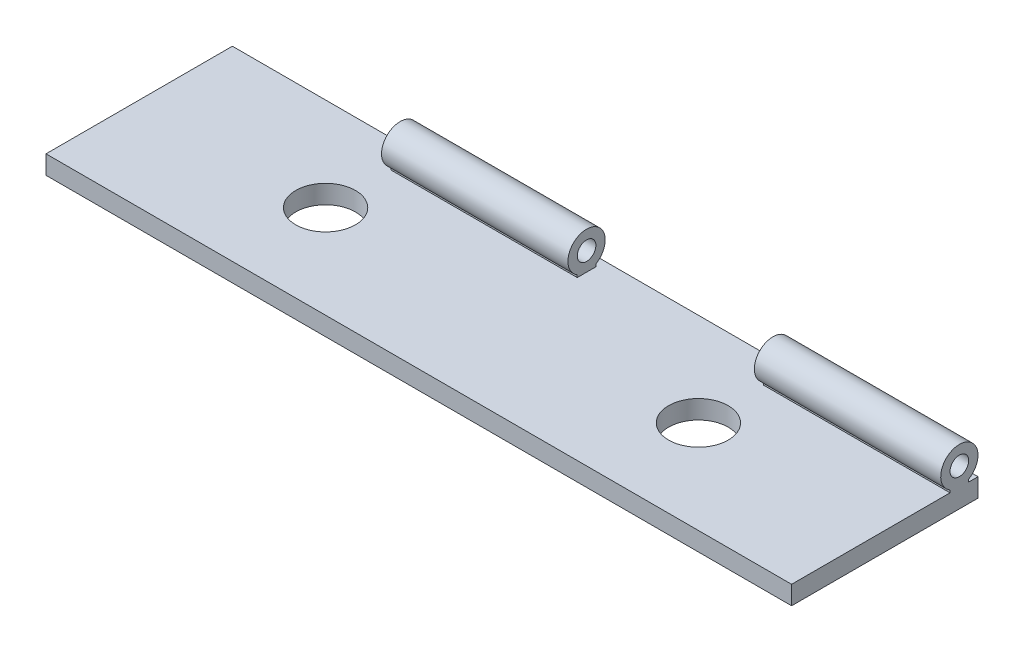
from build123d import *

# Parameters (mm, degrees)
SKETCH1_W          = 40
SKETCH1_H          = 10
SKETCH1_R          = 1.6
EXTRUDE1_DEPTH     = 1
SKETCH2_R          = 0.5
EXTRUDE2_DEPTH     = 40
SKETCH4_W          = 10
SKETCH4_H          = 15.847841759
SKETCH4_H_2        = 14.215399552
CUT_EXTRUDE2_DEPTH = 10


with BuildPart() as part:
    # Sketch1 → Extrude1 (new body)
    with BuildSketch(Plane(origin=(0, 0, 0), x_dir=(1, 0, 0), z_dir=(0, 1, 0))):
        with Locations((20, 5)):
            Rectangle(SKETCH1_W, SKETCH1_H)
        with Locations(Location((30, 5, 0), (0, 0, 270))):
            Circle(SKETCH1_R, mode=Mode.SUBTRACT)
        with Locations(Location((10, 5, 0), (0, 0, 270))):
            Circle(SKETCH1_R, mode=Mode.SUBTRACT)
    extrude(amount=EXTRUDE1_DEPTH)

    # Sketch2 → Extrude2 (add)
    with BuildSketch(Plane(origin=(40, 0, 0), x_dir=(0, 0, -1), z_dir=(1, 0, 0))):
        with BuildLine():
            Line((8.5, 1), (9.5, 1))
            Line((9.5, 1), (9.5, 1.133974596))
            ThreePointArc((9.5, 1.133974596), (9, 3), (8.5, 1.133974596))
            Line((8.5, 1.133974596), (8.5, 1))
        make_face()
        with Locations((9, 2)):
            Circle(SKETCH2_R, mode=Mode.SUBTRACT)
    extrude(amount=-EXTRUDE2_DEPTH)

    # Sketch4 → Cut-Extrude2 (cut)
    with BuildSketch(Plane(origin=(0, 1, 0), x_dir=(-1, 0, 0), z_dir=(0, 1, 0))):
        with Locations((-5, -7.92392088)):
            Rectangle(SKETCH4_W, SKETCH4_H)
        with Locations((-25, -7.107699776)):
            Rectangle(SKETCH4_W, SKETCH4_H_2)
    extrude(amount=CUT_EXTRUDE2_DEPTH, mode=Mode.SUBTRACT)


solid = part.part
